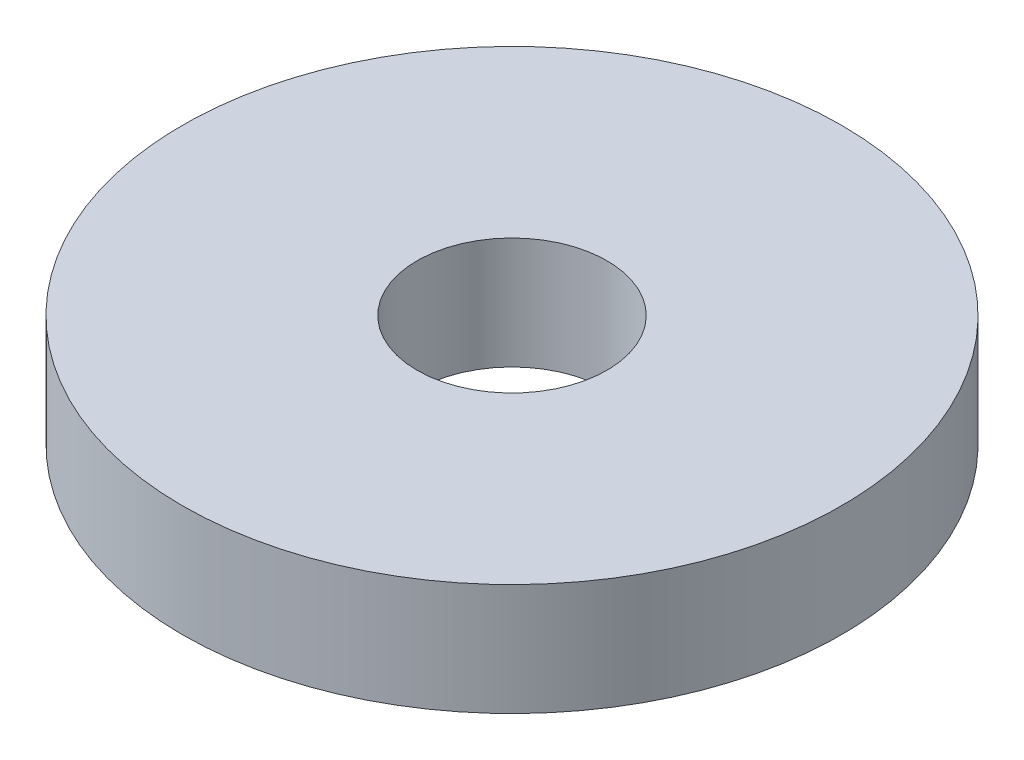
ISO-10303-21;
HEADER;
FILE_DESCRIPTION(('STEP AP214'),'2;1');
FILE_NAME('part.step','',(''),(''),'','','');
FILE_SCHEMA(('AUTOMOTIVE_DESIGN { 1 0 10303 214 1 1 1 1 }'));
ENDSEC;
DATA;
#1=APPLICATION_CONTEXT('core data for automotive mechanical design processes');
#2=APPLICATION_PROTOCOL_DEFINITION('international standard','automotive_design',2000,#1);
#3=PRODUCT_CONTEXT('',#1,'mechanical');
#4=PRODUCT('Part','Part','',(#3));
#5=PRODUCT_RELATED_PRODUCT_CATEGORY('part','',(#4));
#6=PRODUCT_DEFINITION_FORMATION('','',#4);
#7=PRODUCT_DEFINITION_CONTEXT('part definition',#1,'design');
#8=PRODUCT_DEFINITION('design','',#6,#7);
#9=PRODUCT_DEFINITION_SHAPE('','',#8);
#10=(LENGTH_UNIT() NAMED_UNIT(*) SI_UNIT(.MILLI.,.METRE.));
#11=(NAMED_UNIT(*) PLANE_ANGLE_UNIT() SI_UNIT($,.RADIAN.));
#12=(NAMED_UNIT(*) SI_UNIT($,.STERADIAN.) SOLID_ANGLE_UNIT());
#13=UNCERTAINTY_MEASURE_WITH_UNIT(LENGTH_MEASURE(1.E-05),#10,'distance_accuracy_value','');
#14=(GEOMETRIC_REPRESENTATION_CONTEXT(3) GLOBAL_UNCERTAINTY_ASSIGNED_CONTEXT((#13)) GLOBAL_UNIT_ASSIGNED_CONTEXT((#10,
#11,#12)) REPRESENTATION_CONTEXT('',''));
#15=CARTESIAN_POINT('',(0.,0.,0.));
#16=DIRECTION('',(0.,0.,1.));
#17=DIRECTION('',(1.,0.,0.));
#18=AXIS2_PLACEMENT_3D('',#15,#16,#17);
#19=CARTESIAN_POINT('',(0.,10.,0.));
#20=DIRECTION('',(0.,1.,0.));
#21=DIRECTION('',(0.,0.,1.));
#22=AXIS2_PLACEMENT_3D('',#19,#20,#21);
#23=PLANE('',#22);
#24=CARTESIAN_POINT('',(0.,10.,0.));
#25=DIRECTION('',(0.,1.,0.));
#26=DIRECTION('',(0.,0.,1.));
#27=AXIS2_PLACEMENT_3D('',#24,#25,#26);
#28=CIRCLE('',#27,29.5);
#29=CARTESIAN_POINT('',(0.,10.,29.5));
#30=VERTEX_POINT('',#29);
#31=EDGE_CURVE('E10',#30,#30,#28,.T.);
#32=ORIENTED_EDGE('',*,*,#31,.T.);
#33=EDGE_LOOP('',(#32));
#34=FACE_BOUND('',#33,.T.);
#35=CARTESIAN_POINT('',(0.,10.,0.));
#36=DIRECTION('',(0.,1.,0.));
#37=DIRECTION('',(0.,0.,1.));
#38=AXIS2_PLACEMENT_3D('',#35,#36,#37);
#39=CIRCLE('',#38,8.5);
#40=CARTESIAN_POINT('',(0.,10.,8.5));
#41=VERTEX_POINT('',#40);
#42=EDGE_CURVE('E46',#41,#41,#39,.T.);
#43=ORIENTED_EDGE('',*,*,#42,.F.);
#44=EDGE_LOOP('',(#43));
#45=FACE_BOUND('',#44,.T.);
#46=ADVANCED_FACE('F35',(#34,#45),#23,.T.);
#47=CARTESIAN_POINT('',(0.,0.,0.));
#48=DIRECTION('',(0.,1.,0.));
#49=DIRECTION('',(0.,0.,1.));
#50=AXIS2_PLACEMENT_3D('',#47,#48,#49);
#51=PLANE('',#50);
#52=CARTESIAN_POINT('',(0.,0.,0.));
#53=DIRECTION('',(0.,1.,0.));
#54=DIRECTION('',(0.,0.,1.));
#55=AXIS2_PLACEMENT_3D('',#52,#53,#54);
#56=CIRCLE('',#55,29.5);
#57=CARTESIAN_POINT('',(0.,0.,29.5));
#58=VERTEX_POINT('',#57);
#59=EDGE_CURVE('E39',#58,#58,#56,.T.);
#60=ORIENTED_EDGE('',*,*,#59,.F.);
#61=EDGE_LOOP('',(#60));
#62=FACE_BOUND('',#61,.T.);
#63=CARTESIAN_POINT('',(0.,0.,0.));
#64=DIRECTION('',(0.,1.,0.));
#65=DIRECTION('',(0.,0.,1.));
#66=AXIS2_PLACEMENT_3D('',#63,#64,#65);
#67=CIRCLE('',#66,8.5);
#68=CARTESIAN_POINT('',(0.,0.,8.5));
#69=VERTEX_POINT('',#68);
#70=EDGE_CURVE('E48',#69,#69,#67,.T.);
#71=ORIENTED_EDGE('',*,*,#70,.T.);
#72=EDGE_LOOP('',(#71));
#73=FACE_BOUND('',#72,.T.);
#74=ADVANCED_FACE('F58',(#62,#73),#51,.F.);
#75=CARTESIAN_POINT('',(0.,10.,0.));
#76=DIRECTION('',(0.,-1.,0.));
#77=DIRECTION('',(0.,0.,-1.));
#78=AXIS2_PLACEMENT_3D('',#75,#76,#77);
#79=CYLINDRICAL_SURFACE('',#78,29.5);
#80=ORIENTED_EDGE('',*,*,#31,.F.);
#81=EDGE_LOOP('',(#80));
#82=FACE_BOUND('',#81,.T.);
#83=ORIENTED_EDGE('',*,*,#59,.T.);
#84=EDGE_LOOP('',(#83));
#85=FACE_BOUND('',#84,.T.);
#86=ADVANCED_FACE('F37',(#82,#85),#79,.T.);
#87=CARTESIAN_POINT('',(0.,10.,0.));
#88=DIRECTION('',(0.,-1.,0.));
#89=DIRECTION('',(0.,0.,-1.));
#90=AXIS2_PLACEMENT_3D('',#87,#88,#89);
#91=CYLINDRICAL_SURFACE('',#90,8.5);
#92=ORIENTED_EDGE('',*,*,#42,.T.);
#93=EDGE_LOOP('',(#92));
#94=FACE_BOUND('',#93,.T.);
#95=ORIENTED_EDGE('',*,*,#70,.F.);
#96=EDGE_LOOP('',(#95));
#97=FACE_BOUND('',#96,.T.);
#98=ADVANCED_FACE('F54',(#94,#97),#91,.F.);
#99=CLOSED_SHELL('',(#46,#74,#86,#98));
#100=MANIFOLD_SOLID_BREP('B2',#99);
#101=ADVANCED_BREP_SHAPE_REPRESENTATION('',(#18,#100),#14);
#102=SHAPE_DEFINITION_REPRESENTATION(#9,#101);
ENDSEC;
END-ISO-10303-21;
